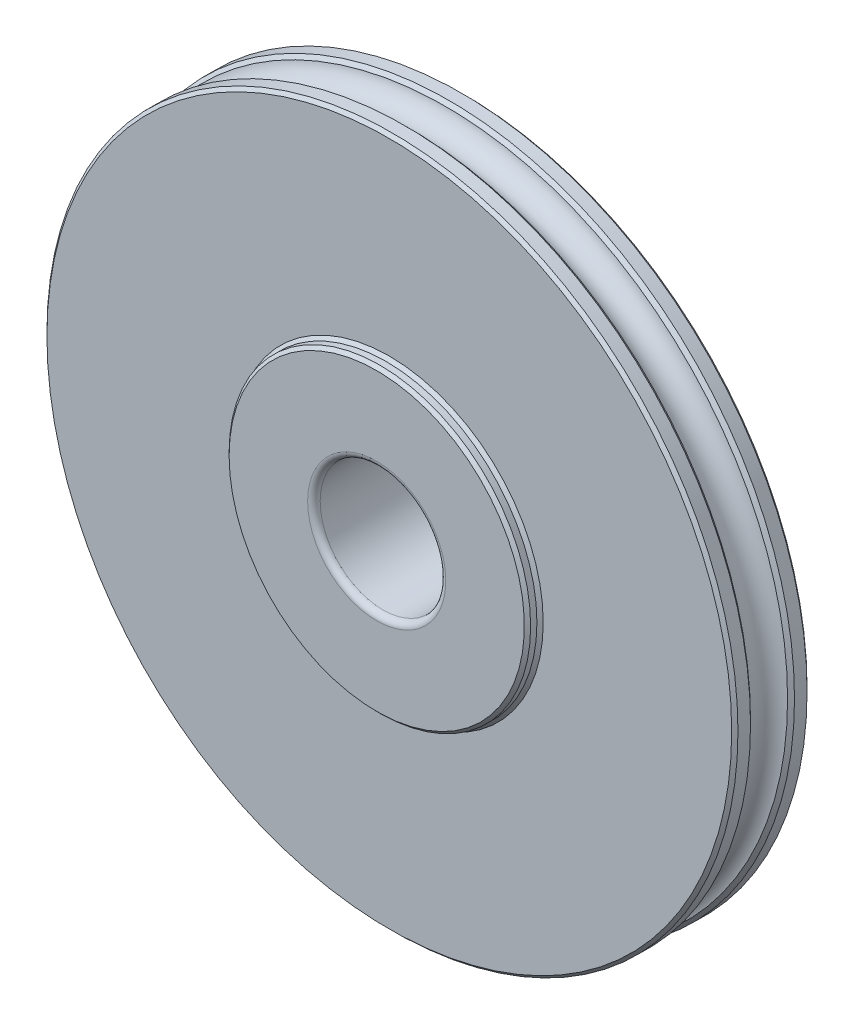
ISO-10303-21;
HEADER;
FILE_DESCRIPTION(('STEP AP214'),'2;1');
FILE_NAME('part.step','',(''),(''),'','','');
FILE_SCHEMA(('AUTOMOTIVE_DESIGN { 1 0 10303 214 1 1 1 1 }'));
ENDSEC;
DATA;
#1=APPLICATION_CONTEXT('core data for automotive mechanical design processes');
#2=APPLICATION_PROTOCOL_DEFINITION('international standard','automotive_design',2000,#1);
#3=PRODUCT_CONTEXT('',#1,'mechanical');
#4=PRODUCT('Part','Part','',(#3));
#5=PRODUCT_RELATED_PRODUCT_CATEGORY('part','',(#4));
#6=PRODUCT_DEFINITION_FORMATION('','',#4);
#7=PRODUCT_DEFINITION_CONTEXT('part definition',#1,'design');
#8=PRODUCT_DEFINITION('design','',#6,#7);
#9=PRODUCT_DEFINITION_SHAPE('','',#8);
#10=(LENGTH_UNIT() NAMED_UNIT(*) SI_UNIT(.MILLI.,.METRE.));
#11=(NAMED_UNIT(*) PLANE_ANGLE_UNIT() SI_UNIT($,.RADIAN.));
#12=(NAMED_UNIT(*) SI_UNIT($,.STERADIAN.) SOLID_ANGLE_UNIT());
#13=UNCERTAINTY_MEASURE_WITH_UNIT(LENGTH_MEASURE(1.E-05),#10,'distance_accuracy_value','');
#14=(GEOMETRIC_REPRESENTATION_CONTEXT(3) GLOBAL_UNCERTAINTY_ASSIGNED_CONTEXT((#13)) GLOBAL_UNIT_ASSIGNED_CONTEXT((#10,
#11,#12)) REPRESENTATION_CONTEXT('',''));
#15=CARTESIAN_POINT('',(0.,0.,0.));
#16=DIRECTION('',(0.,0.,1.));
#17=DIRECTION('',(1.,0.,0.));
#18=AXIS2_PLACEMENT_3D('',#15,#16,#17);
#19=CARTESIAN_POINT('',(0.,5.,4.));
#20=DIRECTION('',(0.,0.,-1.));
#21=DIRECTION('',(-1.,0.,0.));
#22=AXIS2_PLACEMENT_3D('',#19,#20,#21);
#23=PLANE('',#22);
#24=CARTESIAN_POINT('',(0.,0.,4.));
#25=DIRECTION('',(0.,0.,-1.));
#26=DIRECTION('',(-1.,0.,0.));
#27=AXIS2_PLACEMENT_3D('',#24,#25,#26);
#28=CIRCLE('',#27,5.5);
#29=CARTESIAN_POINT('',(-5.5,0.,4.));
#30=VERTEX_POINT('',#29);
#31=EDGE_CURVE('E36',#30,#30,#28,.T.);
#32=ORIENTED_EDGE('',*,*,#31,.T.);
#33=EDGE_LOOP('',(#32));
#34=FACE_BOUND('',#33,.T.);
#35=CARTESIAN_POINT('',(0.,0.,4.));
#36=DIRECTION('',(0.,0.,-1.));
#37=DIRECTION('',(-1.,0.,0.));
#38=AXIS2_PLACEMENT_3D('',#35,#36,#37);
#39=CIRCLE('',#38,11.75);
#40=CARTESIAN_POINT('',(-11.75,0.,4.));
#41=VERTEX_POINT('',#40);
#42=EDGE_CURVE('E49',#41,#41,#39,.F.);
#43=ORIENTED_EDGE('',*,*,#42,.T.);
#44=EDGE_LOOP('',(#43));
#45=FACE_BOUND('',#44,.T.);
#46=ADVANCED_FACE('F29',(#34,#45),#23,.F.);
#47=CARTESIAN_POINT('',(0.,0.,4.));
#48=DIRECTION('',(0.,0.,1.));
#49=DIRECTION('',(1.,0.,0.));
#50=AXIS2_PLACEMENT_3D('',#47,#48,#49);
#51=CYLINDRICAL_SURFACE('',#50,5.);
#52=CARTESIAN_POINT('',(0.,0.,3.5));
#53=DIRECTION('',(0.,0.,-1.));
#54=DIRECTION('',(-1.,0.,0.));
#55=AXIS2_PLACEMENT_3D('',#52,#53,#54);
#56=CIRCLE('',#55,5.);
#57=CARTESIAN_POINT('',(-5.,0.,3.5));
#58=VERTEX_POINT('',#57);
#59=EDGE_CURVE('E40',#58,#58,#56,.F.);
#60=ORIENTED_EDGE('',*,*,#59,.T.);
#61=EDGE_LOOP('',(#60));
#62=FACE_BOUND('',#61,.T.);
#63=CARTESIAN_POINT('',(0.,0.,-3.5));
#64=DIRECTION('',(0.,0.,1.));
#65=DIRECTION('',(1.,0.,0.));
#66=AXIS2_PLACEMENT_3D('',#63,#64,#65);
#67=CIRCLE('',#66,5.);
#68=CARTESIAN_POINT('',(5.,0.,-3.5));
#69=VERTEX_POINT('',#68);
#70=EDGE_CURVE('E44',#69,#69,#67,.F.);
#71=ORIENTED_EDGE('',*,*,#70,.T.);
#72=EDGE_LOOP('',(#71));
#73=FACE_BOUND('',#72,.T.);
#74=ADVANCED_FACE('F135',(#62,#73),#51,.F.);
#75=CARTESIAN_POINT('',(0.,5.,-4.));
#76=DIRECTION('',(0.,0.,1.));
#77=DIRECTION('',(1.,0.,0.));
#78=AXIS2_PLACEMENT_3D('',#75,#76,#77);
#79=PLANE('',#78);
#80=CARTESIAN_POINT('',(0.,0.,-4.));
#81=DIRECTION('',(0.,0.,1.));
#82=DIRECTION('',(1.,0.,0.));
#83=AXIS2_PLACEMENT_3D('',#80,#81,#82);
#84=CIRCLE('',#83,5.5);
#85=CARTESIAN_POINT('',(5.5,0.,-4.));
#86=VERTEX_POINT('',#85);
#87=EDGE_CURVE('E10',#86,#86,#84,.T.);
#88=ORIENTED_EDGE('',*,*,#87,.T.);
#89=EDGE_LOOP('',(#88));
#90=FACE_BOUND('',#89,.T.);
#91=CARTESIAN_POINT('',(0.,0.,-4.));
#92=DIRECTION('',(0.,0.,1.));
#93=DIRECTION('',(1.,0.,0.));
#94=AXIS2_PLACEMENT_3D('',#91,#92,#93);
#95=CIRCLE('',#94,11.75);
#96=CARTESIAN_POINT('',(11.75,0.,-4.));
#97=VERTEX_POINT('',#96);
#98=EDGE_CURVE('E58',#97,#97,#95,.F.);
#99=ORIENTED_EDGE('',*,*,#98,.T.);
#100=EDGE_LOOP('',(#99));
#101=FACE_BOUND('',#100,.T.);
#102=ADVANCED_FACE('F140',(#90,#101),#79,.F.);
#103=CARTESIAN_POINT('',(0.,0.,4.));
#104=DIRECTION('',(0.,0.,1.));
#105=DIRECTION('',(1.,0.,0.));
#106=AXIS2_PLACEMENT_3D('',#103,#104,#105);
#107=CYLINDRICAL_SURFACE('',#106,12.);
#108=CARTESIAN_POINT('',(0.,0.,-3.75));
#109=DIRECTION('',(0.,0.,1.));
#110=DIRECTION('',(1.,0.,0.));
#111=AXIS2_PLACEMENT_3D('',#108,#109,#110);
#112=CIRCLE('',#111,12.);
#113=CARTESIAN_POINT('',(12.,0.,-3.75));
#114=VERTEX_POINT('',#113);
#115=EDGE_CURVE('E61',#114,#114,#112,.T.);
#116=ORIENTED_EDGE('',*,*,#115,.T.);
#117=EDGE_LOOP('',(#116));
#118=FACE_BOUND('',#117,.T.);
#119=CARTESIAN_POINT('',(0.,0.,-3.24999999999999));
#120=DIRECTION('',(0.,0.,1.));
#121=DIRECTION('',(1.,0.,0.));
#122=AXIS2_PLACEMENT_3D('',#119,#120,#121);
#123=CIRCLE('',#122,12.);
#124=CARTESIAN_POINT('',(12.,0.,-3.24999999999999));
#125=VERTEX_POINT('',#124);
#126=EDGE_CURVE('E64',#125,#125,#123,.F.);
#127=ORIENTED_EDGE('',*,*,#126,.T.);
#128=EDGE_LOOP('',(#127));
#129=FACE_BOUND('',#128,.T.);
#130=ADVANCED_FACE('F188',(#118,#129),#107,.T.);
#131=CARTESIAN_POINT('',(0.,12.,-3.));
#132=DIRECTION('',(0.,0.,1.));
#133=DIRECTION('',(1.,0.,0.));
#134=AXIS2_PLACEMENT_3D('',#131,#132,#133);
#135=PLANE('',#134);
#136=CARTESIAN_POINT('',(0.,0.,-3.));
#137=DIRECTION('',(0.,0.,1.));
#138=DIRECTION('',(1.,0.,0.));
#139=AXIS2_PLACEMENT_3D('',#136,#137,#138);
#140=CIRCLE('',#139,27.25);
#141=CARTESIAN_POINT('',(27.25,0.,-3.));
#142=VERTEX_POINT('',#141);
#143=EDGE_CURVE('E67',#142,#142,#140,.F.);
#144=ORIENTED_EDGE('',*,*,#143,.T.);
#145=EDGE_LOOP('',(#144));
#146=FACE_BOUND('',#145,.T.);
#147=CARTESIAN_POINT('',(0.,0.,-3.));
#148=DIRECTION('',(0.,0.,1.));
#149=DIRECTION('',(1.,0.,0.));
#150=AXIS2_PLACEMENT_3D('',#147,#148,#149);
#151=CIRCLE('',#150,12.25);
#152=CARTESIAN_POINT('',(12.25,0.,-3.));
#153=VERTEX_POINT('',#152);
#154=EDGE_CURVE('E70',#153,#153,#151,.T.);
#155=ORIENTED_EDGE('',*,*,#154,.T.);
#156=EDGE_LOOP('',(#155));
#157=FACE_BOUND('',#156,.T.);
#158=ADVANCED_FACE('F287',(#146,#157),#135,.F.);
#159=CARTESIAN_POINT('',(0.,0.,4.));
#160=DIRECTION('',(0.,0.,1.));
#161=DIRECTION('',(1.,0.,0.));
#162=AXIS2_PLACEMENT_3D('',#159,#160,#161);
#163=CYLINDRICAL_SURFACE('',#162,27.5);
#164=CARTESIAN_POINT('',(0.,0.,-2.75));
#165=DIRECTION('',(0.,0.,1.));
#166=DIRECTION('',(1.,0.,0.));
#167=AXIS2_PLACEMENT_3D('',#164,#165,#166);
#168=CIRCLE('',#167,27.5);
#169=CARTESIAN_POINT('',(27.5,0.,-2.75));
#170=VERTEX_POINT('',#169);
#171=EDGE_CURVE('E73',#170,#170,#168,.T.);
#172=ORIENTED_EDGE('',*,*,#171,.T.);
#173=EDGE_LOOP('',(#172));
#174=FACE_BOUND('',#173,.T.);
#175=CARTESIAN_POINT('',(0.,0.,-1.75000000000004));
#176=DIRECTION('',(0.,0.,-1.));
#177=DIRECTION('',(-1.,0.,0.));
#178=AXIS2_PLACEMENT_3D('',#175,#176,#177);
#179=CIRCLE('',#178,27.5);
#180=CARTESIAN_POINT('',(-27.5,0.,-1.75000000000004));
#181=VERTEX_POINT('',#180);
#182=EDGE_CURVE('E76',#181,#181,#179,.T.);
#183=ORIENTED_EDGE('',*,*,#182,.T.);
#184=EDGE_LOOP('',(#183));
#185=FACE_BOUND('',#184,.T.);
#186=ADVANCED_FACE('F277',(#174,#185),#163,.T.);
#187=CARTESIAN_POINT('',(0.,0.,0.));
#188=DIRECTION('',(0.,0.,1.));
#189=DIRECTION('',(1.,0.,0.));
#190=AXIS2_PLACEMENT_3D('',#187,#188,#189);
#191=TOROIDAL_SURFACE('',#190,27.5,1.5);
#192=CARTESIAN_POINT('',(0.,0.,1.47447894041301));
#193=DIRECTION('',(0.,0.,-1.));
#194=DIRECTION('',(-1.,0.,0.));
#195=AXIS2_PLACEMENT_3D('',#192,#193,#194);
#196=CIRCLE('',#195,27.2244789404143);
#197=CARTESIAN_POINT('',(-27.2244789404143,0.,1.47447894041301));
#198=VERTEX_POINT('',#197);
#199=EDGE_CURVE('E85',#198,#198,#196,.T.);
#200=ORIENTED_EDGE('',*,*,#199,.T.);
#201=EDGE_LOOP('',(#200));
#202=FACE_BOUND('',#201,.T.);
#203=CARTESIAN_POINT('',(0.,0.,-1.47447894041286));
#204=DIRECTION('',(0.,0.,1.));
#205=DIRECTION('',(1.,0.,0.));
#206=AXIS2_PLACEMENT_3D('',#203,#204,#205);
#207=CIRCLE('',#206,27.2244789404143);
#208=CARTESIAN_POINT('',(27.2244789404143,0.,-1.47447894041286));
#209=VERTEX_POINT('',#208);
#210=EDGE_CURVE('E88',#209,#209,#207,.T.);
#211=ORIENTED_EDGE('',*,*,#210,.T.);
#212=EDGE_LOOP('',(#211));
#213=FACE_BOUND('',#212,.T.);
#214=ADVANCED_FACE('F267',(#202,#213),#191,.F.);
#215=CARTESIAN_POINT('',(0.,0.,4.));
#216=DIRECTION('',(0.,0.,1.));
#217=DIRECTION('',(1.,0.,0.));
#218=AXIS2_PLACEMENT_3D('',#215,#216,#217);
#219=CYLINDRICAL_SURFACE('',#218,27.5);
#220=CARTESIAN_POINT('',(0.,0.,1.75));
#221=DIRECTION('',(0.,0.,1.));
#222=DIRECTION('',(1.,0.,0.));
#223=AXIS2_PLACEMENT_3D('',#220,#221,#222);
#224=CIRCLE('',#223,27.5);
#225=CARTESIAN_POINT('',(27.5,0.,1.75));
#226=VERTEX_POINT('',#225);
#227=EDGE_CURVE('E91',#226,#226,#224,.T.);
#228=ORIENTED_EDGE('',*,*,#227,.T.);
#229=EDGE_LOOP('',(#228));
#230=FACE_BOUND('',#229,.T.);
#231=CARTESIAN_POINT('',(0.,0.,2.75));
#232=DIRECTION('',(0.,0.,-1.));
#233=DIRECTION('',(-1.,0.,0.));
#234=AXIS2_PLACEMENT_3D('',#231,#232,#233);
#235=CIRCLE('',#234,27.5);
#236=CARTESIAN_POINT('',(-27.5,0.,2.75));
#237=VERTEX_POINT('',#236);
#238=EDGE_CURVE('E94',#237,#237,#235,.T.);
#239=ORIENTED_EDGE('',*,*,#238,.T.);
#240=EDGE_LOOP('',(#239));
#241=FACE_BOUND('',#240,.T.);
#242=ADVANCED_FACE('F98',(#230,#241),#219,.T.);
#243=CARTESIAN_POINT('',(0.,12.,3.));
#244=DIRECTION('',(0.,0.,-1.));
#245=DIRECTION('',(-1.,0.,0.));
#246=AXIS2_PLACEMENT_3D('',#243,#244,#245);
#247=PLANE('',#246);
#248=CARTESIAN_POINT('',(0.,0.,3.));
#249=DIRECTION('',(0.,0.,-1.));
#250=DIRECTION('',(-1.,0.,0.));
#251=AXIS2_PLACEMENT_3D('',#248,#249,#250);
#252=CIRCLE('',#251,27.25);
#253=CARTESIAN_POINT('',(-27.25,0.,3.));
#254=VERTEX_POINT('',#253);
#255=EDGE_CURVE('E79',#254,#254,#252,.F.);
#256=ORIENTED_EDGE('',*,*,#255,.T.);
#257=EDGE_LOOP('',(#256));
#258=FACE_BOUND('',#257,.T.);
#259=CARTESIAN_POINT('',(0.,0.,3.));
#260=DIRECTION('',(0.,0.,-1.));
#261=DIRECTION('',(-1.,0.,0.));
#262=AXIS2_PLACEMENT_3D('',#259,#260,#261);
#263=CIRCLE('',#262,12.25);
#264=CARTESIAN_POINT('',(-12.25,0.,3.));
#265=VERTEX_POINT('',#264);
#266=EDGE_CURVE('E82',#265,#265,#263,.T.);
#267=ORIENTED_EDGE('',*,*,#266,.T.);
#268=EDGE_LOOP('',(#267));
#269=FACE_BOUND('',#268,.T.);
#270=ADVANCED_FACE('F108',(#258,#269),#247,.F.);
#271=CARTESIAN_POINT('',(0.,0.,4.));
#272=DIRECTION('',(0.,0.,1.));
#273=DIRECTION('',(1.,0.,0.));
#274=AXIS2_PLACEMENT_3D('',#271,#272,#273);
#275=CYLINDRICAL_SURFACE('',#274,12.);
#276=CARTESIAN_POINT('',(0.,0.,3.25000000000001));
#277=DIRECTION('',(0.,0.,-1.));
#278=DIRECTION('',(-1.,0.,0.));
#279=AXIS2_PLACEMENT_3D('',#276,#277,#278);
#280=CIRCLE('',#279,12.);
#281=CARTESIAN_POINT('',(-12.,0.,3.25000000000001));
#282=VERTEX_POINT('',#281);
#283=EDGE_CURVE('E52',#282,#282,#280,.F.);
#284=ORIENTED_EDGE('',*,*,#283,.T.);
#285=EDGE_LOOP('',(#284));
#286=FACE_BOUND('',#285,.T.);
#287=CARTESIAN_POINT('',(0.,0.,3.74999999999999));
#288=DIRECTION('',(0.,0.,-1.));
#289=DIRECTION('',(-1.,0.,0.));
#290=AXIS2_PLACEMENT_3D('',#287,#288,#289);
#291=CIRCLE('',#290,12.);
#292=CARTESIAN_POINT('',(-12.,0.,3.74999999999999));
#293=VERTEX_POINT('',#292);
#294=EDGE_CURVE('E55',#293,#293,#291,.T.);
#295=ORIENTED_EDGE('',*,*,#294,.T.);
#296=EDGE_LOOP('',(#295));
#297=FACE_BOUND('',#296,.T.);
#298=ADVANCED_FACE('F111',(#286,#297),#275,.T.);
#299=CARTESIAN_POINT('',(0.,0.,1.75));
#300=DIRECTION('',(0.,0.,1.));
#301=DIRECTION('',(1.,0.,0.));
#302=AXIS2_PLACEMENT_3D('',#299,#300,#301);
#303=CONICAL_SURFACE('',#302,27.5,0.785398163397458);
#304=ORIENTED_EDGE('',*,*,#199,.F.);
#305=EDGE_LOOP('',(#304));
#306=FACE_BOUND('',#305,.T.);
#307=ORIENTED_EDGE('',*,*,#227,.F.);
#308=EDGE_LOOP('',(#307));
#309=FACE_BOUND('',#308,.T.);
#310=ADVANCED_FACE('F104',(#306,#309),#303,.T.);
#311=CARTESIAN_POINT('',(0.,0.,3.));
#312=DIRECTION('',(0.,0.,-1.));
#313=DIRECTION('',(-1.,0.,0.));
#314=AXIS2_PLACEMENT_3D('',#311,#312,#313);
#315=CONICAL_SURFACE('',#314,27.25,0.785398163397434);
#316=ORIENTED_EDGE('',*,*,#238,.F.);
#317=EDGE_LOOP('',(#316));
#318=FACE_BOUND('',#317,.T.);
#319=ORIENTED_EDGE('',*,*,#255,.F.);
#320=EDGE_LOOP('',(#319));
#321=FACE_BOUND('',#320,.T.);
#322=ADVANCED_FACE('F100',(#318,#321),#315,.T.);
#323=CARTESIAN_POINT('',(0.,0.,-2.75));
#324=DIRECTION('',(0.,0.,1.));
#325=DIRECTION('',(1.,0.,0.));
#326=AXIS2_PLACEMENT_3D('',#323,#324,#325);
#327=CONICAL_SURFACE('',#326,27.5,0.785398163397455);
#328=ORIENTED_EDGE('',*,*,#143,.F.);
#329=EDGE_LOOP('',(#328));
#330=FACE_BOUND('',#329,.T.);
#331=ORIENTED_EDGE('',*,*,#171,.F.);
#332=EDGE_LOOP('',(#331));
#333=FACE_BOUND('',#332,.T.);
#334=ADVANCED_FACE('F103',(#330,#333),#327,.T.);
#335=CARTESIAN_POINT('',(0.,0.,-1.47447894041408));
#336=DIRECTION('',(0.,0.,-1.));
#337=DIRECTION('',(-1.,0.,0.));
#338=AXIS2_PLACEMENT_3D('',#335,#336,#337);
#339=CONICAL_SURFACE('',#338,27.2244789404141,0.785398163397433);
#340=ORIENTED_EDGE('',*,*,#182,.F.);
#341=EDGE_LOOP('',(#340));
#342=FACE_BOUND('',#341,.T.);
#343=ORIENTED_EDGE('',*,*,#210,.F.);
#344=EDGE_LOOP('',(#343));
#345=FACE_BOUND('',#344,.T.);
#346=ADVANCED_FACE('F150',(#342,#345),#339,.T.);
#347=CARTESIAN_POINT('',(0.,0.,-3.75));
#348=DIRECTION('',(0.,0.,1.));
#349=DIRECTION('',(1.,0.,0.));
#350=AXIS2_PLACEMENT_3D('',#347,#348,#349);
#351=CONICAL_SURFACE('',#350,12.,0.785398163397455);
#352=ORIENTED_EDGE('',*,*,#98,.F.);
#353=EDGE_LOOP('',(#352));
#354=FACE_BOUND('',#353,.T.);
#355=ORIENTED_EDGE('',*,*,#115,.F.);
#356=EDGE_LOOP('',(#355));
#357=FACE_BOUND('',#356,.T.);
#358=ADVANCED_FACE('F154',(#354,#357),#351,.T.);
#359=CARTESIAN_POINT('',(0.,0.,-3.));
#360=DIRECTION('',(0.,0.,1.));
#361=DIRECTION('',(1.,0.,0.));
#362=AXIS2_PLACEMENT_3D('',#359,#360,#361);
#363=CONICAL_SURFACE('',#362,12.25,0.785398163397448);
#364=ORIENTED_EDGE('',*,*,#126,.F.);
#365=EDGE_LOOP('',(#364));
#366=FACE_BOUND('',#365,.T.);
#367=ORIENTED_EDGE('',*,*,#154,.F.);
#368=EDGE_LOOP('',(#367));
#369=FACE_BOUND('',#368,.T.);
#370=ADVANCED_FACE('F119',(#366,#369),#363,.T.);
#371=CARTESIAN_POINT('',(0.,0.,3.25000000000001));
#372=DIRECTION('',(0.,0.,-1.));
#373=DIRECTION('',(-1.,0.,0.));
#374=AXIS2_PLACEMENT_3D('',#371,#372,#373);
#375=CONICAL_SURFACE('',#374,12.,0.785398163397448);
#376=ORIENTED_EDGE('',*,*,#266,.F.);
#377=EDGE_LOOP('',(#376));
#378=FACE_BOUND('',#377,.T.);
#379=ORIENTED_EDGE('',*,*,#283,.F.);
#380=EDGE_LOOP('',(#379));
#381=FACE_BOUND('',#380,.T.);
#382=ADVANCED_FACE('F115',(#378,#381),#375,.T.);
#383=CARTESIAN_POINT('',(0.,0.,4.));
#384=DIRECTION('',(0.,0.,-1.));
#385=DIRECTION('',(-1.,0.,0.));
#386=AXIS2_PLACEMENT_3D('',#383,#384,#385);
#387=CONICAL_SURFACE('',#386,11.75,0.785398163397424);
#388=ORIENTED_EDGE('',*,*,#294,.F.);
#389=EDGE_LOOP('',(#388));
#390=FACE_BOUND('',#389,.T.);
#391=ORIENTED_EDGE('',*,*,#42,.F.);
#392=EDGE_LOOP('',(#391));
#393=FACE_BOUND('',#392,.T.);
#394=ADVANCED_FACE('F118',(#390,#393),#387,.T.);
#395=CARTESIAN_POINT('',(0.,0.,3.5));
#396=DIRECTION('',(0.,0.,-1.));
#397=DIRECTION('',(-1.,0.,0.));
#398=AXIS2_PLACEMENT_3D('',#395,#396,#397);
#399=TOROIDAL_SURFACE('',#398,5.5,0.5);
#400=ORIENTED_EDGE('',*,*,#31,.F.);
#401=EDGE_LOOP('',(#400));
#402=FACE_BOUND('',#401,.T.);
#403=ORIENTED_EDGE('',*,*,#59,.F.);
#404=EDGE_LOOP('',(#403));
#405=FACE_BOUND('',#404,.T.);
#406=ADVANCED_FACE('F130',(#402,#405),#399,.T.);
#407=CARTESIAN_POINT('',(0.,0.,-3.5));
#408=DIRECTION('',(0.,0.,1.));
#409=DIRECTION('',(1.,0.,0.));
#410=AXIS2_PLACEMENT_3D('',#407,#408,#409);
#411=TOROIDAL_SURFACE('',#410,5.5,0.5);
#412=ORIENTED_EDGE('',*,*,#70,.F.);
#413=EDGE_LOOP('',(#412));
#414=FACE_BOUND('',#413,.T.);
#415=ORIENTED_EDGE('',*,*,#87,.F.);
#416=EDGE_LOOP('',(#415));
#417=FACE_BOUND('',#416,.T.);
#418=ADVANCED_FACE('F31',(#414,#417),#411,.T.);
#419=CLOSED_SHELL('',(#46,#74,#102,#130,#158,#186,#214,#242,#270,#298,#310,#322,#334,#346,#358,
#370,#382,#394,#406,#418));
#420=MANIFOLD_SOLID_BREP('B2',#419);
#421=ADVANCED_BREP_SHAPE_REPRESENTATION('',(#18,#420),#14);
#422=SHAPE_DEFINITION_REPRESENTATION(#9,#421);
ENDSEC;
END-ISO-10303-21;
